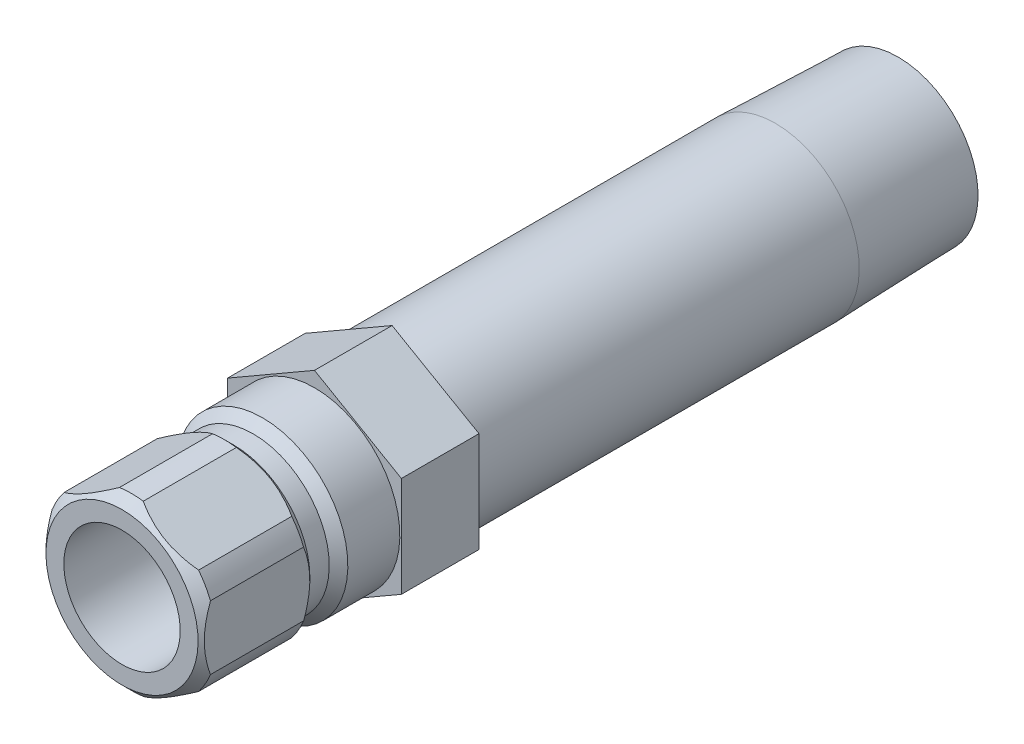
ISO-10303-21;
HEADER;
FILE_DESCRIPTION(('STEP AP214'),'2;1');
FILE_NAME('part.step','',(''),(''),'','','');
FILE_SCHEMA(('AUTOMOTIVE_DESIGN { 1 0 10303 214 1 1 1 1 }'));
ENDSEC;
DATA;
#1=APPLICATION_CONTEXT('core data for automotive mechanical design processes');
#2=APPLICATION_PROTOCOL_DEFINITION('international standard','automotive_design',2000,#1);
#3=PRODUCT_CONTEXT('',#1,'mechanical');
#4=PRODUCT('Part','Part','',(#3));
#5=PRODUCT_RELATED_PRODUCT_CATEGORY('part','',(#4));
#6=PRODUCT_DEFINITION_FORMATION('','',#4);
#7=PRODUCT_DEFINITION_CONTEXT('part definition',#1,'design');
#8=PRODUCT_DEFINITION('design','',#6,#7);
#9=PRODUCT_DEFINITION_SHAPE('','',#8);
#10=(LENGTH_UNIT() NAMED_UNIT(*) SI_UNIT(.MILLI.,.METRE.));
#11=(NAMED_UNIT(*) PLANE_ANGLE_UNIT() SI_UNIT($,.RADIAN.));
#12=(NAMED_UNIT(*) SI_UNIT($,.STERADIAN.) SOLID_ANGLE_UNIT());
#13=UNCERTAINTY_MEASURE_WITH_UNIT(LENGTH_MEASURE(1.E-05),#10,'distance_accuracy_value','');
#14=(GEOMETRIC_REPRESENTATION_CONTEXT(3) GLOBAL_UNCERTAINTY_ASSIGNED_CONTEXT((#13)) GLOBAL_UNIT_ASSIGNED_CONTEXT((#10,
#11,#12)) REPRESENTATION_CONTEXT('',''));
#15=CARTESIAN_POINT('',(0.,0.,0.));
#16=DIRECTION('',(0.,0.,1.));
#17=DIRECTION('',(1.,0.,0.));
#18=AXIS2_PLACEMENT_3D('',#15,#16,#17);
#19=CARTESIAN_POINT('',(0.,0.,12.8748331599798));
#20=DIRECTION('',(0.,0.,-1.));
#21=DIRECTION('',(0.,1.,0.));
#22=AXIS2_PLACEMENT_3D('',#19,#20,#21);
#23=CYLINDRICAL_SURFACE('',#22,6.985);
#24=DIRECTION('',(0.,0.,-1.));
#25=VECTOR('',#24,1.);
#26=CARTESIAN_POINT('',(5.50323442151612,-4.30170151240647,12.8748331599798));
#27=LINE('',#26,#25);
#28=CARTESIAN_POINT('',(5.50323442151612,-4.30170151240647,7.366));
#29=VERTEX_POINT('',#28);
#30=CARTESIAN_POINT('',(5.50323442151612,-4.30170151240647,14.986));
#31=VERTEX_POINT('',#30);
#32=EDGE_CURVE('E452',#29,#31,#27,.F.);
#33=ORIENTED_EDGE('',*,*,#32,.F.);
#34=CARTESIAN_POINT('',(0.,0.,7.366));
#35=DIRECTION('',(0.,0.,-1.));
#36=DIRECTION('',(0.,1.,0.));
#37=AXIS2_PLACEMENT_3D('',#34,#35,#36);
#38=CIRCLE('',#37,6.985);
#39=CARTESIAN_POINT('',(6.477,-2.6150900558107,7.366));
#40=VERTEX_POINT('',#39);
#41=EDGE_CURVE('E190',#40,#29,#38,.T.);
#42=ORIENTED_EDGE('',*,*,#41,.F.);
#43=DIRECTION('',(0.,0.,-1.));
#44=VECTOR('',#43,1.);
#45=CARTESIAN_POINT('',(6.477,-2.6150900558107,12.8748331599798));
#46=LINE('',#45,#44);
#47=CARTESIAN_POINT('',(6.477,-2.6150900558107,14.986));
#48=VERTEX_POINT('',#47);
#49=EDGE_CURVE('E367',#48,#40,#46,.T.);
#50=ORIENTED_EDGE('',*,*,#49,.F.);
#51=CARTESIAN_POINT('',(0.,0.,14.986));
#52=DIRECTION('',(0.,0.,-1.));
#53=DIRECTION('',(0.,1.,0.));
#54=AXIS2_PLACEMENT_3D('',#51,#52,#53);
#55=CIRCLE('',#54,6.985);
#56=EDGE_CURVE('E355',#48,#31,#55,.T.);
#57=ORIENTED_EDGE('',*,*,#56,.T.);
#58=EDGE_LOOP('',(#33,#42,#50,#57));
#59=FACE_BOUND('',#58,.T.);
#60=ADVANCED_FACE('F34',(#59),#23,.T.);
#61=DIRECTION('',(0.,0.,-1.));
#62=VECTOR('',#61,1.);
#63=CARTESIAN_POINT('',(6.477,2.6150900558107,12.8748331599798));
#64=LINE('',#63,#62);
#65=CARTESIAN_POINT('',(6.477,2.6150900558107,7.366));
#66=VERTEX_POINT('',#65);
#67=CARTESIAN_POINT('',(6.477,2.6150900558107,14.986));
#68=VERTEX_POINT('',#67);
#69=EDGE_CURVE('E279',#66,#68,#64,.F.);
#70=ORIENTED_EDGE('',*,*,#69,.F.);
#71=CARTESIAN_POINT('',(5.50323442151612,4.30170151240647,7.366));
#72=VERTEX_POINT('',#71);
#73=EDGE_CURVE('E193',#72,#66,#38,.T.);
#74=ORIENTED_EDGE('',*,*,#73,.F.);
#75=DIRECTION('',(0.,0.,-1.));
#76=VECTOR('',#75,1.);
#77=CARTESIAN_POINT('',(5.50323442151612,4.30170151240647,12.8748331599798));
#78=LINE('',#77,#76);
#79=CARTESIAN_POINT('',(5.50323442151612,4.30170151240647,14.986));
#80=VERTEX_POINT('',#79);
#81=EDGE_CURVE('E351',#80,#72,#78,.T.);
#82=ORIENTED_EDGE('',*,*,#81,.F.);
#83=EDGE_CURVE('E205',#80,#68,#55,.T.);
#84=ORIENTED_EDGE('',*,*,#83,.T.);
#85=EDGE_LOOP('',(#70,#74,#82,#84));
#86=FACE_BOUND('',#85,.T.);
#87=ADVANCED_FACE('F313',(#86),#23,.T.);
#88=DIRECTION('',(0.,0.,-1.));
#89=VECTOR('',#88,1.);
#90=CARTESIAN_POINT('',(0.973765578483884,6.91679156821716,12.8748331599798));
#91=LINE('',#90,#89);
#92=CARTESIAN_POINT('',(0.973765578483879,6.91679156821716,7.366));
#93=VERTEX_POINT('',#92);
#94=CARTESIAN_POINT('',(0.973765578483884,6.91679156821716,14.986));
#95=VERTEX_POINT('',#94);
#96=EDGE_CURVE('E370',#93,#95,#91,.F.);
#97=ORIENTED_EDGE('',*,*,#96,.F.);
#98=CARTESIAN_POINT('',(-0.97376557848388,6.91679156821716,7.366));
#99=VERTEX_POINT('',#98);
#100=EDGE_CURVE('E195',#99,#93,#38,.T.);
#101=ORIENTED_EDGE('',*,*,#100,.F.);
#102=DIRECTION('',(0.,0.,-1.));
#103=VECTOR('',#102,1.);
#104=CARTESIAN_POINT('',(-0.973765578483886,6.91679156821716,12.8748331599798));
#105=LINE('',#104,#103);
#106=CARTESIAN_POINT('',(-0.973765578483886,6.91679156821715,14.986));
#107=VERTEX_POINT('',#106);
#108=EDGE_CURVE('E54',#107,#99,#105,.T.);
#109=ORIENTED_EDGE('',*,*,#108,.F.);
#110=EDGE_CURVE('E201',#107,#95,#55,.T.);
#111=ORIENTED_EDGE('',*,*,#110,.T.);
#112=EDGE_LOOP('',(#97,#101,#109,#111));
#113=FACE_BOUND('',#112,.T.);
#114=ADVANCED_FACE('F318',(#113),#23,.T.);
#115=DIRECTION('',(0.,0.,-1.));
#116=VECTOR('',#115,1.);
#117=CARTESIAN_POINT('',(-5.50323442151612,4.30170151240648,12.8748331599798));
#118=LINE('',#117,#116);
#119=CARTESIAN_POINT('',(-5.50323442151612,4.30170151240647,7.366));
#120=VERTEX_POINT('',#119);
#121=CARTESIAN_POINT('',(-5.50323442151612,4.30170151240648,14.986));
#122=VERTEX_POINT('',#121);
#123=EDGE_CURVE('E349',#120,#122,#118,.F.);
#124=ORIENTED_EDGE('',*,*,#123,.F.);
#125=CARTESIAN_POINT('',(-6.477,2.61509005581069,7.366));
#126=VERTEX_POINT('',#125);
#127=EDGE_CURVE('E194',#126,#120,#38,.T.);
#128=ORIENTED_EDGE('',*,*,#127,.F.);
#129=DIRECTION('',(0.,0.,-1.));
#130=VECTOR('',#129,1.);
#131=CARTESIAN_POINT('',(-6.477,2.61509005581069,12.8748331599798));
#132=LINE('',#131,#130);
#133=CARTESIAN_POINT('',(-6.477,2.61509005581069,14.986));
#134=VERTEX_POINT('',#133);
#135=EDGE_CURVE('E62',#134,#126,#132,.T.);
#136=ORIENTED_EDGE('',*,*,#135,.F.);
#137=EDGE_CURVE('E204',#134,#122,#55,.T.);
#138=ORIENTED_EDGE('',*,*,#137,.T.);
#139=EDGE_LOOP('',(#124,#128,#136,#138));
#140=FACE_BOUND('',#139,.T.);
#141=ADVANCED_FACE('F329',(#140),#23,.T.);
#142=DIRECTION('',(0.,0.,-1.));
#143=VECTOR('',#142,1.);
#144=CARTESIAN_POINT('',(-6.477,-2.61509005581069,12.8748331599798));
#145=LINE('',#144,#143);
#146=CARTESIAN_POINT('',(-6.477,-2.61509005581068,7.366));
#147=VERTEX_POINT('',#146);
#148=CARTESIAN_POINT('',(-6.477,-2.61509005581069,14.986));
#149=VERTEX_POINT('',#148);
#150=EDGE_CURVE('E340',#147,#149,#145,.F.);
#151=ORIENTED_EDGE('',*,*,#150,.F.);
#152=CARTESIAN_POINT('',(-5.50323442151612,-4.30170151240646,7.366));
#153=VERTEX_POINT('',#152);
#154=EDGE_CURVE('E191',#153,#147,#38,.T.);
#155=ORIENTED_EDGE('',*,*,#154,.F.);
#156=DIRECTION('',(0.,0.,-1.));
#157=VECTOR('',#156,1.);
#158=CARTESIAN_POINT('',(-5.50323442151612,-4.30170151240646,12.8748331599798));
#159=LINE('',#158,#157);
#160=CARTESIAN_POINT('',(-5.50323442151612,-4.30170151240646,14.986));
#161=VERTEX_POINT('',#160);
#162=EDGE_CURVE('E168',#161,#153,#159,.T.);
#163=ORIENTED_EDGE('',*,*,#162,.F.);
#164=EDGE_CURVE('E342',#161,#149,#55,.T.);
#165=ORIENTED_EDGE('',*,*,#164,.T.);
#166=EDGE_LOOP('',(#151,#155,#163,#165));
#167=FACE_BOUND('',#166,.T.);
#168=ADVANCED_FACE('F322',(#167),#23,.T.);
#169=CARTESIAN_POINT('',(0.,0.,12.8748331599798));
#170=DIRECTION('',(0.,0.,-1.));
#171=DIRECTION('',(0.,1.,0.));
#172=AXIS2_PLACEMENT_3D('',#169,#170,#171);
#173=CYLINDRICAL_SURFACE('',#172,6.85799999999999);
#174=CARTESIAN_POINT('',(0.,0.,-37.719));
#175=DIRECTION('',(0.,0.,-1.));
#176=DIRECTION('',(0.,1.,0.));
#177=AXIS2_PLACEMENT_3D('',#174,#175,#176);
#178=CIRCLE('',#177,6.85799999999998);
#179=CARTESIAN_POINT('',(0.,6.858,-37.719));
#180=VERTEX_POINT('',#179);
#181=EDGE_CURVE('E520',#180,#180,#178,.T.);
#182=ORIENTED_EDGE('',*,*,#181,.F.);
#183=EDGE_LOOP('',(#182));
#184=FACE_BOUND('',#183,.T.);
#185=CARTESIAN_POINT('',(0.,0.,-6.35));
#186=DIRECTION('',(0.,0.,1.));
#187=DIRECTION('',(1.,0.,0.));
#188=AXIS2_PLACEMENT_3D('',#185,#186,#187);
#189=CIRCLE('',#188,6.85799999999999);
#190=CARTESIAN_POINT('',(6.85799999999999,0.,-6.35));
#191=VERTEX_POINT('',#190);
#192=EDGE_CURVE('E496',#191,#191,#189,.F.);
#193=ORIENTED_EDGE('',*,*,#192,.T.);
#194=EDGE_LOOP('',(#193));
#195=FACE_BOUND('',#194,.T.);
#196=ADVANCED_FACE('F328',(#184,#195),#173,.T.);
#197=CARTESIAN_POINT('',(0.,0.,12.8748331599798));
#198=DIRECTION('',(0.,0.,-1.));
#199=DIRECTION('',(0.,1.,0.));
#200=AXIS2_PLACEMENT_3D('',#197,#198,#199);
#201=CYLINDRICAL_SURFACE('',#200,4.7625);
#202=CARTESIAN_POINT('',(0.,0.,3.556));
#203=DIRECTION('',(0.,0.,-1.));
#204=DIRECTION('',(0.,1.,0.));
#205=AXIS2_PLACEMENT_3D('',#202,#203,#204);
#206=CIRCLE('',#205,4.76249999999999);
#207=CARTESIAN_POINT('',(0.,4.7625,3.556));
#208=VERTEX_POINT('',#207);
#209=EDGE_CURVE('E508',#208,#208,#206,.T.);
#210=ORIENTED_EDGE('',*,*,#209,.T.);
#211=EDGE_LOOP('',(#210));
#212=FACE_BOUND('',#211,.T.);
#213=CARTESIAN_POINT('',(0.,0.,15.748));
#214=DIRECTION('',(0.,0.,-1.));
#215=DIRECTION('',(0.,1.,0.));
#216=AXIS2_PLACEMENT_3D('',#213,#214,#215);
#217=CIRCLE('',#216,4.7625);
#218=CARTESIAN_POINT('',(0.,4.7625,15.748));
#219=VERTEX_POINT('',#218);
#220=EDGE_CURVE('E174',#219,#219,#217,.T.);
#221=ORIENTED_EDGE('',*,*,#220,.F.);
#222=EDGE_LOOP('',(#221));
#223=FACE_BOUND('',#222,.T.);
#224=ADVANCED_FACE('F36',(#212,#223),#201,.F.);
#225=CARTESIAN_POINT('',(0.,4.7625,15.748));
#226=DIRECTION('',(0.,0.,1.));
#227=DIRECTION('',(0.,-1.,0.));
#228=AXIS2_PLACEMENT_3D('',#225,#226,#227);
#229=PLANE('',#228);
#230=ORIENTED_EDGE('',*,*,#220,.T.);
#231=EDGE_LOOP('',(#230));
#232=FACE_BOUND('',#231,.T.);
#233=CARTESIAN_POINT('',(0.,0.,15.748));
#234=DIRECTION('',(0.,0.,-1.));
#235=DIRECTION('',(0.,1.,0.));
#236=AXIS2_PLACEMENT_3D('',#233,#234,#235);
#237=CIRCLE('',#236,6.223);
#238=CARTESIAN_POINT('',(0.,6.223,15.748));
#239=VERTEX_POINT('',#238);
#240=EDGE_CURVE('E206',#239,#239,#237,.T.);
#241=ORIENTED_EDGE('',*,*,#240,.F.);
#242=EDGE_LOOP('',(#241));
#243=FACE_BOUND('',#242,.T.);
#244=ADVANCED_FACE('F241',(#232,#243),#229,.T.);
#245=CARTESIAN_POINT('',(0.,0.,14.986));
#246=DIRECTION('',(0.,0.,-1.));
#247=DIRECTION('',(0.,1.,0.));
#248=AXIS2_PLACEMENT_3D('',#245,#246,#247);
#249=CONICAL_SURFACE('',#248,6.985,0.785398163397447);
#250=CARTESIAN_POINT('',(5.50369701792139,-4.30143443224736,14.9858));
#251=CARTESIAN_POINT('',(5.32269478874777,-4.40593611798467,15.0641166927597));
#252=CARTESIAN_POINT('',(5.13917907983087,-4.51188896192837,15.1353544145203));
#253=CARTESIAN_POINT('',(4.76736839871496,-4.72655395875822,15.2608524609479));
#254=CARTESIAN_POINT('',(4.57906245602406,-4.83527244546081,15.3150691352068));
#255=CARTESIAN_POINT('',(4.20553846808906,-5.05092662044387,15.401724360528));
#256=CARTESIAN_POINT('',(4.02044501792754,-5.15779037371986,15.4348622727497));
#257=CARTESIAN_POINT('',(3.64855359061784,-5.37250198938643,15.4802195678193));
#258=CARTESIAN_POINT('',(3.46175806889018,-5.48034843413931,15.4924653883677));
#259=CARTESIAN_POINT('',(3.08219421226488,-5.69948972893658,15.4953056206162));
#260=CARTESIAN_POINT('',(2.88942157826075,-5.81078706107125,15.4852117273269));
#261=CARTESIAN_POINT('',(2.50551871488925,-6.03243348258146,15.4426708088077));
#262=CARTESIAN_POINT('',(2.31439108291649,-6.14278107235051,15.4101933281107));
#263=CARTESIAN_POINT('',(1.92845877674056,-6.36559919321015,15.3234273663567));
#264=CARTESIAN_POINT('',(1.73378601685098,-6.47799356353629,15.268364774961));
#265=CARTESIAN_POINT('',(1.44558978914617,-6.6443837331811,15.1720079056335));
#266=CARTESIAN_POINT('',(1.35026676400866,-6.69941850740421,15.1376422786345));
#267=CARTESIAN_POINT('',(1.16086120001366,-6.80877186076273,15.0647445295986));
#268=CARTESIAN_POINT('',(1.06677820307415,-6.86309070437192,15.0262139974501));
#269=CARTESIAN_POINT('',(0.973302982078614,-6.91705864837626,14.9858));
#270=B_SPLINE_CURVE_WITH_KNOTS('',3,(#250,#251,#252,#253,#254,#255,#256,#257,#258,#259,#260,
#261,#262,#263,#264,#265,#266,#267,#268,#269),.UNSPECIFIED.,.F.,.F.,(4,2,2,2,2,2,2,2,2,4),(0.,
0.669810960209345,1.34132587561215,1.9892054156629,2.63626449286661,3.30353665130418,
3.97171850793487,4.66502165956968,5.01088265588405,5.35661208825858),.UNSPECIFIED.);
#271=CARTESIAN_POINT('',(0.973765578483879,-6.91679156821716,14.986));
#272=VERTEX_POINT('',#271);
#273=EDGE_CURVE('E451',#31,#272,#270,.T.);
#274=ORIENTED_EDGE('',*,*,#273,.F.);
#275=ORIENTED_EDGE('',*,*,#56,.F.);
#276=CARTESIAN_POINT('',(6.477,-7.50531717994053,12.0573066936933));
#277=CARTESIAN_POINT('',(6.477,-7.32278230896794,12.1954662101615));
#278=CARTESIAN_POINT('',(6.477,-7.13923073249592,12.3323042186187));
#279=CARTESIAN_POINT('',(6.477,-6.76969107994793,12.6027438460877));
#280=CARTESIAN_POINT('',(6.477,-6.58370240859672,12.7363446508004));
#281=CARTESIAN_POINT('',(6.477,-6.20752484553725,13.0006667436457));
#282=CARTESIAN_POINT('',(6.477,-6.01731457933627,13.1313577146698));
#283=CARTESIAN_POINT('',(6.477,-5.63367369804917,13.3879087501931));
#284=CARTESIAN_POINT('',(6.477,-5.44024331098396,13.5137691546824));
#285=CARTESIAN_POINT('',(6.477,-5.03831720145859,13.7667102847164));
#286=CARTESIAN_POINT('',(6.477,-4.8295984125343,13.893438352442));
#287=CARTESIAN_POINT('',(6.477,-4.4072839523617,14.1386241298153));
#288=CARTESIAN_POINT('',(6.477,-4.19368750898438,14.2570805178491));
#289=CARTESIAN_POINT('',(6.477,-3.7616267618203,14.4831715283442));
#290=CARTESIAN_POINT('',(6.477,-3.54317924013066,14.5908379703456));
#291=CARTESIAN_POINT('',(6.477,-3.100295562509,14.7929384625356));
#292=CARTESIAN_POINT('',(6.477,-2.87586219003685,14.8873785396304));
#293=CARTESIAN_POINT('',(6.477,-2.43955826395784,15.0524966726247));
#294=CARTESIAN_POINT('',(6.477,-2.22819339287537,15.1244971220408));
#295=CARTESIAN_POINT('',(6.477,-1.80033354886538,15.2515475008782));
#296=CARTESIAN_POINT('',(6.477,-1.58383822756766,15.3065962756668));
#297=CARTESIAN_POINT('',(6.477,-1.15063390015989,15.3959385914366));
#298=CARTESIAN_POINT('',(6.477,-0.934000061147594,15.4305906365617));
#299=CARTESIAN_POINT('',(6.477,-0.498364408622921,15.4784594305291));
#300=CARTESIAN_POINT('',(6.477,-0.279363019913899,15.4916799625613));
#301=CARTESIAN_POINT('',(6.477,0.150697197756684,15.4956835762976));
#302=CARTESIAN_POINT('',(6.477,0.361748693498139,15.4872823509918));
#303=CARTESIAN_POINT('',(6.477,0.782066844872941,15.4503172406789));
#304=CARTESIAN_POINT('',(6.477,0.991333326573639,15.421751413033));
#305=CARTESIAN_POINT('',(6.477,1.41010575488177,15.3455375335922));
#306=CARTESIAN_POINT('',(6.477,1.6195513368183,15.2975631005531));
#307=CARTESIAN_POINT('',(6.477,2.03387291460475,15.1851046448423));
#308=CARTESIAN_POINT('',(6.477,2.2387492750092,15.1206219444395));
#309=CARTESIAN_POINT('',(6.477,2.66141718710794,14.9715598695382));
#310=CARTESIAN_POINT('',(6.477,2.87875617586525,14.8857103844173));
#311=CARTESIAN_POINT('',(6.477,3.30779766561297,14.7008180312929));
#312=CARTESIAN_POINT('',(6.477,3.51949749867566,14.6017690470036));
#313=CARTESIAN_POINT('',(6.477,3.9382898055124,14.3928329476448));
#314=CARTESIAN_POINT('',(6.477,4.14536521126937,14.282911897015));
#315=CARTESIAN_POINT('',(6.477,4.55475391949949,14.0546596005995));
#316=CARTESIAN_POINT('',(6.477,4.75706796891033,13.93632968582));
#317=CARTESIAN_POINT('',(6.477,5.14761370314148,13.6989609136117));
#318=CARTESIAN_POINT('',(6.477,5.33604552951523,13.580249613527));
#319=CARTESIAN_POINT('',(6.477,5.70967381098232,13.3378251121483));
#320=CARTESIAN_POINT('',(6.477,5.89487001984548,13.2141115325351));
#321=CARTESIAN_POINT('',(6.477,6.26095063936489,12.9635958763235));
#322=CARTESIAN_POINT('',(6.477,6.44185783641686,12.8368269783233));
#323=CARTESIAN_POINT('',(6.477,6.80119835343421,12.5799293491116));
#324=CARTESIAN_POINT('',(6.477,6.97963234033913,12.4498015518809));
#325=CARTESIAN_POINT('',(6.477,7.15703038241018,12.3183002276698));
#326=B_SPLINE_CURVE_WITH_KNOTS('',3,(#276,#277,#278,#279,#280,#281,#282,#283,#284,#285,#286,
#287,#288,#289,#290,#291,#292,#293,#294,#295,#296,#297,#298,#299,#300,#301,#302,#303,#304,#305,
#306,#307,#308,#309,#310,#311,#312,#313,#314,#315,#316,#317,#318,#319,#320,#321,#322,#323,#324,
#325),.UNSPECIFIED.,.F.,.F.,(4,2,2,2,2,2,2,2,2,2,2,2,2,2,2,2,2,2,2,2,2,2,2,2,4),(0.,
0.686790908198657,1.37375281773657,2.06603541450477,2.75826919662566,3.49065471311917,
4.22315698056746,4.95343127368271,5.68337170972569,6.35265989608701,7.02199365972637,
7.67918147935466,8.33625327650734,8.96890298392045,9.6016136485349,10.2454384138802,
10.8892116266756,11.5897073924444,12.2905288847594,12.9936114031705,13.6965828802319,
14.3646145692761,15.0326968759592,15.6953618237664,16.3578444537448),.UNSPECIFIED.);
#327=EDGE_CURVE('E271',#68,#48,#326,.F.);
#328=ORIENTED_EDGE('',*,*,#327,.F.);
#329=ORIENTED_EDGE('',*,*,#83,.F.);
#330=CARTESIAN_POINT('',(0.973302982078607,6.91705864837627,14.9858));
#331=CARTESIAN_POINT('',(1.15430521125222,6.81255696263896,15.0641166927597));
#332=CARTESIAN_POINT('',(1.33782092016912,6.70660411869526,15.1353544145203));
#333=CARTESIAN_POINT('',(1.70963160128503,6.49193912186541,15.2608524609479));
#334=CARTESIAN_POINT('',(1.89793754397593,6.38322063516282,15.3150691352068));
#335=CARTESIAN_POINT('',(2.27146153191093,6.16756646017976,15.401724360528));
#336=CARTESIAN_POINT('',(2.45655498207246,6.06070270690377,15.4348622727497));
#337=CARTESIAN_POINT('',(2.82844640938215,5.8459910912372,15.4802195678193));
#338=CARTESIAN_POINT('',(3.01524193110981,5.73814464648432,15.4924653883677));
#339=CARTESIAN_POINT('',(3.39480578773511,5.51900335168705,15.4953056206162));
#340=CARTESIAN_POINT('',(3.58757842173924,5.40770601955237,15.4852117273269));
#341=CARTESIAN_POINT('',(3.97148128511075,5.18605959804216,15.4426708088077));
#342=CARTESIAN_POINT('',(4.16260891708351,5.07571200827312,15.4101933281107));
#343=CARTESIAN_POINT('',(4.54854122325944,4.85289388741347,15.3234273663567));
#344=CARTESIAN_POINT('',(4.74321398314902,4.74049951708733,15.268364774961));
#345=CARTESIAN_POINT('',(5.03141021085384,4.57410934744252,15.1720079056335));
#346=CARTESIAN_POINT('',(5.12673323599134,4.51907457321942,15.1376422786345));
#347=CARTESIAN_POINT('',(5.31613879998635,4.40972121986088,15.0647445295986));
#348=CARTESIAN_POINT('',(5.41022179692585,4.3554023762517,15.0262139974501));
#349=CARTESIAN_POINT('',(5.50369701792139,4.30143443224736,14.9858));
#350=B_SPLINE_CURVE_WITH_KNOTS('',3,(#330,#331,#332,#333,#334,#335,#336,#337,#338,#339,#340,
#341,#342,#343,#344,#345,#346,#347,#348,#349),.UNSPECIFIED.,.F.,.F.,(4,2,2,2,2,2,2,2,2,4),(0.,
0.669810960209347,1.34132587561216,1.9892054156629,2.63626449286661,3.30353665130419,
3.97171850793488,4.66502165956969,5.01088265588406,5.35661208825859),.UNSPECIFIED.);
#351=EDGE_CURVE('E263',#95,#80,#350,.T.);
#352=ORIENTED_EDGE('',*,*,#351,.F.);
#353=ORIENTED_EDGE('',*,*,#110,.F.);
#354=CARTESIAN_POINT('',(-5.50369701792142,4.30143443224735,14.9858));
#355=CARTESIAN_POINT('',(-5.3226947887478,4.40593611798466,15.0641166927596));
#356=CARTESIAN_POINT('',(-5.1391790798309,4.51188896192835,15.1353544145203));
#357=CARTESIAN_POINT('',(-4.76736839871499,4.72655395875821,15.2608524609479));
#358=CARTESIAN_POINT('',(-4.57906245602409,4.8352724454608,15.3150691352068));
#359=CARTESIAN_POINT('',(-4.20553846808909,5.05092662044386,15.401724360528));
#360=CARTESIAN_POINT('',(-4.02044501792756,5.15779037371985,15.4348622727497));
#361=CARTESIAN_POINT('',(-3.64855359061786,5.37250198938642,15.4802195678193));
#362=CARTESIAN_POINT('',(-3.4617580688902,5.4803484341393,15.4924653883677));
#363=CARTESIAN_POINT('',(-3.0821942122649,5.69948972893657,15.4953056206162));
#364=CARTESIAN_POINT('',(-2.88942157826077,5.81078706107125,15.4852117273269));
#365=CARTESIAN_POINT('',(-2.50551871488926,6.03243348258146,15.4426708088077));
#366=CARTESIAN_POINT('',(-2.3143910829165,6.14278107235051,15.4101933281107));
#367=CARTESIAN_POINT('',(-1.92845877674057,6.36559919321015,15.3234273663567));
#368=CARTESIAN_POINT('',(-1.73378601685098,6.47799356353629,15.268364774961));
#369=CARTESIAN_POINT('',(-1.44558978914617,6.6443837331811,15.1720079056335));
#370=CARTESIAN_POINT('',(-1.35026676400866,6.69941850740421,15.1376422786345));
#371=CARTESIAN_POINT('',(-1.16086120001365,6.80877186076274,15.0647445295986));
#372=CARTESIAN_POINT('',(-1.06677820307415,6.86309070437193,15.0262139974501));
#373=CARTESIAN_POINT('',(-0.97330298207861,6.91705864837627,14.9858));
#374=B_SPLINE_CURVE_WITH_KNOTS('',3,(#354,#355,#356,#357,#358,#359,#360,#361,#362,#363,#364,
#365,#366,#367,#368,#369,#370,#371,#372,#373),.UNSPECIFIED.,.F.,.F.,(4,2,2,2,2,2,2,2,2,4),(0.,
0.66981096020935,1.34132587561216,1.98920541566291,2.63626449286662,3.3035366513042,
3.9717185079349,4.66502165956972,5.01088265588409,5.35661208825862),.UNSPECIFIED.);
#375=EDGE_CURVE('E256',#122,#107,#374,.T.);
#376=ORIENTED_EDGE('',*,*,#375,.F.);
#377=ORIENTED_EDGE('',*,*,#137,.F.);
#378=CARTESIAN_POINT('',(-6.477,-7.50531717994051,12.0573066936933));
#379=CARTESIAN_POINT('',(-6.477,-7.32278230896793,12.1954662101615));
#380=CARTESIAN_POINT('',(-6.477,-7.13923073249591,12.3323042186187));
#381=CARTESIAN_POINT('',(-6.477,-6.76969107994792,12.6027438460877));
#382=CARTESIAN_POINT('',(-6.477,-6.58370240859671,12.7363446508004));
#383=CARTESIAN_POINT('',(-6.477,-6.20752484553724,13.0006667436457));
#384=CARTESIAN_POINT('',(-6.477,-6.01731457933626,13.1313577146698));
#385=CARTESIAN_POINT('',(-6.477,-5.63367369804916,13.3879087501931));
#386=CARTESIAN_POINT('',(-6.477,-5.44024331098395,13.5137691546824));
#387=CARTESIAN_POINT('',(-6.477,-5.03831720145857,13.7667102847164));
#388=CARTESIAN_POINT('',(-6.477,-4.82959841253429,13.8934383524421));
#389=CARTESIAN_POINT('',(-6.477,-4.40728395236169,14.1386241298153));
#390=CARTESIAN_POINT('',(-6.477,-4.19368750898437,14.2570805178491));
#391=CARTESIAN_POINT('',(-6.477,-3.76162676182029,14.4831715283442));
#392=CARTESIAN_POINT('',(-6.477,-3.54317924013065,14.5908379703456));
#393=CARTESIAN_POINT('',(-6.477,-3.10029556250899,14.7929384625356));
#394=CARTESIAN_POINT('',(-6.477,-2.87586219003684,14.8873785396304));
#395=CARTESIAN_POINT('',(-6.477,-2.43955826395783,15.0524966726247));
#396=CARTESIAN_POINT('',(-6.477,-2.22819339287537,15.1244971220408));
#397=CARTESIAN_POINT('',(-6.477,-1.80033354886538,15.2515475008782));
#398=CARTESIAN_POINT('',(-6.477,-1.58383822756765,15.3065962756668));
#399=CARTESIAN_POINT('',(-6.477,-1.15063390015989,15.3959385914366));
#400=CARTESIAN_POINT('',(-6.477,-0.934000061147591,15.4305906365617));
#401=CARTESIAN_POINT('',(-6.477,-0.49836440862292,15.4784594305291));
#402=CARTESIAN_POINT('',(-6.477,-0.279363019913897,15.4916799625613));
#403=CARTESIAN_POINT('',(-6.477,0.150697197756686,15.4956835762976));
#404=CARTESIAN_POINT('',(-6.477,0.361748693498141,15.4872823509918));
#405=CARTESIAN_POINT('',(-6.477,0.782066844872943,15.4503172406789));
#406=CARTESIAN_POINT('',(-6.477,0.991333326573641,15.421751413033));
#407=CARTESIAN_POINT('',(-6.477,1.41010575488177,15.3455375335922));
#408=CARTESIAN_POINT('',(-6.477,1.6195513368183,15.2975631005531));
#409=CARTESIAN_POINT('',(-6.477,2.03387291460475,15.1851046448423));
#410=CARTESIAN_POINT('',(-6.477,2.2387492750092,15.1206219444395));
#411=CARTESIAN_POINT('',(-6.477,2.66141718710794,14.9715598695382));
#412=CARTESIAN_POINT('',(-6.477,2.87875617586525,14.8857103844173));
#413=CARTESIAN_POINT('',(-6.477,3.30779766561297,14.7008180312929));
#414=CARTESIAN_POINT('',(-6.477,3.51949749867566,14.6017690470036));
#415=CARTESIAN_POINT('',(-6.477,3.93828980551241,14.3928329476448));
#416=CARTESIAN_POINT('',(-6.477,4.14536521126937,14.282911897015));
#417=CARTESIAN_POINT('',(-6.477,4.55475391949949,14.0546596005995));
#418=CARTESIAN_POINT('',(-6.477,4.75706796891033,13.93632968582));
#419=CARTESIAN_POINT('',(-6.477,5.14761370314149,13.6989609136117));
#420=CARTESIAN_POINT('',(-6.477,5.33604552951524,13.580249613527));
#421=CARTESIAN_POINT('',(-6.477,5.70967381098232,13.3378251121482));
#422=CARTESIAN_POINT('',(-6.477,5.89487001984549,13.2141115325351));
#423=CARTESIAN_POINT('',(-6.477,6.2609506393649,12.9635958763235));
#424=CARTESIAN_POINT('',(-6.477,6.44185783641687,12.8368269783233));
#425=CARTESIAN_POINT('',(-6.477,6.80119835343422,12.5799293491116));
#426=CARTESIAN_POINT('',(-6.477,6.97963234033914,12.4498015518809));
#427=CARTESIAN_POINT('',(-6.477,7.15703038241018,12.3183002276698));
#428=B_SPLINE_CURVE_WITH_KNOTS('',3,(#378,#379,#380,#381,#382,#383,#384,#385,#386,#387,#388,
#389,#390,#391,#392,#393,#394,#395,#396,#397,#398,#399,#400,#401,#402,#403,#404,#405,#406,#407,
#408,#409,#410,#411,#412,#413,#414,#415,#416,#417,#418,#419,#420,#421,#422,#423,#424,#425,#426,
#427),.UNSPECIFIED.,.F.,.F.,(4,2,2,2,2,2,2,2,2,2,2,2,2,2,2,2,2,2,2,2,2,2,2,2,4),(0.,
0.686790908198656,1.37375281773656,2.06603541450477,2.75826919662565,3.49065471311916,
4.22315698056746,4.9534312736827,5.68337170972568,6.352659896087,7.02199365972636,
7.67918147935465,8.33625327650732,8.96890298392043,9.60161364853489,10.2454384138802,
10.8892116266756,11.5897073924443,12.2905288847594,12.9936114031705,13.6965828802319,
14.3646145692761,15.0326968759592,15.6953618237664,16.3578444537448),.UNSPECIFIED.);
#429=EDGE_CURVE('E249',#149,#134,#428,.T.);
#430=ORIENTED_EDGE('',*,*,#429,.F.);
#431=ORIENTED_EDGE('',*,*,#164,.F.);
#432=CARTESIAN_POINT('',(-0.973302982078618,-6.91705864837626,14.9858));
#433=CARTESIAN_POINT('',(-1.15430521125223,-6.81255696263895,15.0641166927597));
#434=CARTESIAN_POINT('',(-1.33782092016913,-6.70660411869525,15.1353544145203));
#435=CARTESIAN_POINT('',(-1.70963160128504,-6.49193912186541,15.2608524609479));
#436=CARTESIAN_POINT('',(-1.89793754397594,-6.38322063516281,15.3150691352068));
#437=CARTESIAN_POINT('',(-2.27146153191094,-6.16756646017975,15.401724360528));
#438=CARTESIAN_POINT('',(-2.45655498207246,-6.06070270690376,15.4348622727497));
#439=CARTESIAN_POINT('',(-2.82844640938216,-5.84599109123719,15.4802195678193));
#440=CARTESIAN_POINT('',(-3.01524193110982,-5.73814464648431,15.4924653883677));
#441=CARTESIAN_POINT('',(-3.39480578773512,-5.51900335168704,15.4953056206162));
#442=CARTESIAN_POINT('',(-3.58757842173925,-5.40770601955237,15.4852117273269));
#443=CARTESIAN_POINT('',(-3.97148128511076,-5.18605959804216,15.4426708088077));
#444=CARTESIAN_POINT('',(-4.16260891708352,-5.07571200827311,15.4101933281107));
#445=CARTESIAN_POINT('',(-4.54854122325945,-4.85289388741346,15.3234273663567));
#446=CARTESIAN_POINT('',(-4.74321398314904,-4.74049951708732,15.268364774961));
#447=CARTESIAN_POINT('',(-5.03141021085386,-4.57410934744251,15.1720079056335));
#448=CARTESIAN_POINT('',(-5.12673323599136,-4.5190745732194,15.1376422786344));
#449=CARTESIAN_POINT('',(-5.31613879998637,-4.40972121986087,15.0647445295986));
#450=CARTESIAN_POINT('',(-5.41022179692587,-4.35540237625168,15.0262139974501));
#451=CARTESIAN_POINT('',(-5.50369701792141,-4.30143443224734,14.9858));
#452=B_SPLINE_CURVE_WITH_KNOTS('',3,(#432,#433,#434,#435,#436,#437,#438,#439,#440,#441,#442,
#443,#444,#445,#446,#447,#448,#449,#450,#451),.UNSPECIFIED.,.F.,.F.,(4,2,2,2,2,2,2,2,2,4),(0.,
0.669810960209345,1.34132587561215,1.9892054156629,2.6362644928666,3.30353665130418,
3.97171850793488,4.6650216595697,5.01088265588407,5.35661208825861),.UNSPECIFIED.);
#453=CARTESIAN_POINT('',(-0.973765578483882,-6.91679156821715,14.986));
#454=VERTEX_POINT('',#453);
#455=EDGE_CURVE('E184',#454,#161,#452,.T.);
#456=ORIENTED_EDGE('',*,*,#455,.F.);
#457=EDGE_CURVE('E183',#272,#454,#55,.T.);
#458=ORIENTED_EDGE('',*,*,#457,.F.);
#459=EDGE_LOOP('',(#274,#275,#328,#329,#352,#353,#376,#377,#430,#431,#456,#458));
#460=FACE_BOUND('',#459,.T.);
#461=ORIENTED_EDGE('',*,*,#240,.T.);
#462=EDGE_LOOP('',(#461));
#463=FACE_BOUND('',#462,.T.);
#464=ADVANCED_FACE('F238',(#460,#463),#249,.T.);
#465=DIRECTION('',(0.,0.,-1.));
#466=VECTOR('',#465,1.);
#467=CARTESIAN_POINT('',(0.973765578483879,-6.91679156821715,12.8748331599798));
#468=LINE('',#467,#466);
#469=CARTESIAN_POINT('',(0.973765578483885,-6.91679156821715,7.366));
#470=VERTEX_POINT('',#469);
#471=EDGE_CURVE('E278',#272,#470,#468,.T.);
#472=ORIENTED_EDGE('',*,*,#471,.F.);
#473=ORIENTED_EDGE('',*,*,#457,.T.);
#474=DIRECTION('',(0.,0.,-1.));
#475=VECTOR('',#474,1.);
#476=CARTESIAN_POINT('',(-0.973765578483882,-6.91679156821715,12.8748331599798));
#477=LINE('',#476,#475);
#478=CARTESIAN_POINT('',(-0.973765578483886,-6.91679156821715,7.366));
#479=VERTEX_POINT('',#478);
#480=EDGE_CURVE('E165',#479,#454,#477,.F.);
#481=ORIENTED_EDGE('',*,*,#480,.F.);
#482=EDGE_CURVE('E181',#470,#479,#38,.T.);
#483=ORIENTED_EDGE('',*,*,#482,.F.);
#484=EDGE_LOOP('',(#472,#473,#481,#483));
#485=FACE_BOUND('',#484,.T.);
#486=ADVANCED_FACE('F180',(#485),#23,.T.);
#487=CARTESIAN_POINT('',(0.,0.,6.604));
#488=DIRECTION('',(0.,0.,1.));
#489=DIRECTION('',(0.,-1.,0.));
#490=AXIS2_PLACEMENT_3D('',#487,#488,#489);
#491=CONICAL_SURFACE('',#490,6.223,0.785398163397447);
#492=CARTESIAN_POINT('',(0.973302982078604,-6.91705864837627,7.3662));
#493=CARTESIAN_POINT('',(1.15430521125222,-6.81255696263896,7.28788330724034));
#494=CARTESIAN_POINT('',(1.33782092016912,-6.70660411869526,7.21664558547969));
#495=CARTESIAN_POINT('',(1.70963160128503,-6.49193912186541,7.09114753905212));
#496=CARTESIAN_POINT('',(1.89793754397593,-6.38322063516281,7.03693086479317));
#497=CARTESIAN_POINT('',(2.27146153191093,-6.16756646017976,6.95027563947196));
#498=CARTESIAN_POINT('',(2.45655498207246,-6.06070270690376,6.91713772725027));
#499=CARTESIAN_POINT('',(2.82844640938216,-5.8459910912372,6.87178043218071));
#500=CARTESIAN_POINT('',(3.01524193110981,-5.73814464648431,6.85953461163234));
#501=CARTESIAN_POINT('',(3.39480578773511,-5.51900335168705,6.85669437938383));
#502=CARTESIAN_POINT('',(3.58757842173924,-5.40770601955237,6.86678827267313));
#503=CARTESIAN_POINT('',(3.97148128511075,-5.18605959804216,6.9093291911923));
#504=CARTESIAN_POINT('',(4.16260891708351,-5.07571200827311,6.9418066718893));
#505=CARTESIAN_POINT('',(4.54854122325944,-4.85289388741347,7.02857263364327));
#506=CARTESIAN_POINT('',(4.74321398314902,-4.74049951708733,7.08363522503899));
#507=CARTESIAN_POINT('',(5.03141021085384,-4.57410934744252,7.17999209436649));
#508=CARTESIAN_POINT('',(5.12673323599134,-4.51907457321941,7.21435772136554));
#509=CARTESIAN_POINT('',(5.31613879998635,-4.40972121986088,7.28725547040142));
#510=CARTESIAN_POINT('',(5.41022179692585,-4.35540237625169,7.32578600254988));
#511=CARTESIAN_POINT('',(5.50369701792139,-4.30143443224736,7.3662));
#512=B_SPLINE_CURVE_WITH_KNOTS('',3,(#492,#493,#494,#495,#496,#497,#498,#499,#500,#501,#502,
#503,#504,#505,#506,#507,#508,#509,#510,#511),.UNSPECIFIED.,.F.,.F.,(4,2,2,2,2,2,2,2,2,4),(0.,
0.669810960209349,1.34132587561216,1.9892054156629,2.63626449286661,3.30353665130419,
3.97171850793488,4.6650216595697,5.01088265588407,5.3566120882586),.UNSPECIFIED.);
#513=EDGE_CURVE('E12',#470,#29,#512,.T.);
#514=ORIENTED_EDGE('',*,*,#513,.F.);
#515=ORIENTED_EDGE('',*,*,#482,.T.);
#516=CARTESIAN_POINT('',(-5.50369701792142,-4.30143443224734,7.36620000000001));
#517=CARTESIAN_POINT('',(-5.32269478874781,-4.40593611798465,7.28788330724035));
#518=CARTESIAN_POINT('',(-5.13917907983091,-4.51188896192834,7.2166455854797));
#519=CARTESIAN_POINT('',(-4.767368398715,-4.7265539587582,7.09114753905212));
#520=CARTESIAN_POINT('',(-4.57906245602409,-4.83527244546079,7.03693086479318));
#521=CARTESIAN_POINT('',(-4.20553846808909,-5.05092662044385,6.95027563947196));
#522=CARTESIAN_POINT('',(-4.02044501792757,-5.15779037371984,6.91713772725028));
#523=CARTESIAN_POINT('',(-3.64855359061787,-5.37250198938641,6.87178043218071));
#524=CARTESIAN_POINT('',(-3.46175806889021,-5.48034843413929,6.85953461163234));
#525=CARTESIAN_POINT('',(-3.08219421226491,-5.69948972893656,6.85669437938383));
#526=CARTESIAN_POINT('',(-2.88942157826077,-5.81078706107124,6.86678827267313));
#527=CARTESIAN_POINT('',(-2.50551871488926,-6.03243348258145,6.9093291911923));
#528=CARTESIAN_POINT('',(-2.3143910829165,-6.1427810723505,6.9418066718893));
#529=CARTESIAN_POINT('',(-1.92845877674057,-6.36559919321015,7.02857263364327));
#530=CARTESIAN_POINT('',(-1.73378601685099,-6.47799356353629,7.08363522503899));
#531=CARTESIAN_POINT('',(-1.44558978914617,-6.6443837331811,7.17999209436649));
#532=CARTESIAN_POINT('',(-1.35026676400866,-6.69941850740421,7.21435772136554));
#533=CARTESIAN_POINT('',(-1.16086120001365,-6.80877186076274,7.28725547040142));
#534=CARTESIAN_POINT('',(-1.06677820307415,-6.86309070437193,7.32578600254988));
#535=CARTESIAN_POINT('',(-0.97330298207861,-6.91705864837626,7.3662));
#536=B_SPLINE_CURVE_WITH_KNOTS('',3,(#516,#517,#518,#519,#520,#521,#522,#523,#524,#525,#526,
#527,#528,#529,#530,#531,#532,#533,#534,#535),.UNSPECIFIED.,.F.,.F.,(4,2,2,2,2,2,2,2,2,4),(0.,
0.669810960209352,1.34132587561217,1.98920541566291,2.63626449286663,3.30353665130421,
3.9717185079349,4.66502165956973,5.0108826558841,5.35661208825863),.UNSPECIFIED.);
#537=EDGE_CURVE('E162',#153,#479,#536,.T.);
#538=ORIENTED_EDGE('',*,*,#537,.F.);
#539=ORIENTED_EDGE('',*,*,#154,.T.);
#540=CARTESIAN_POINT('',(-6.477,-7.50531717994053,10.2946933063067));
#541=CARTESIAN_POINT('',(-6.477,-7.32278230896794,10.1565337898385));
#542=CARTESIAN_POINT('',(-6.477,-7.13923073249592,10.0196957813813));
#543=CARTESIAN_POINT('',(-6.477,-6.76969107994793,9.74925615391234));
#544=CARTESIAN_POINT('',(-6.477,-6.58370240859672,9.61565534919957));
#545=CARTESIAN_POINT('',(-6.477,-6.20752484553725,9.35133325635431));
#546=CARTESIAN_POINT('',(-6.477,-6.01731457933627,9.22064228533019));
#547=CARTESIAN_POINT('',(-6.477,-5.63367369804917,8.96409124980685));
#548=CARTESIAN_POINT('',(-6.477,-5.44024331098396,8.83823084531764));
#549=CARTESIAN_POINT('',(-6.477,-5.03831720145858,8.58528971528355));
#550=CARTESIAN_POINT('',(-6.477,-4.8295984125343,8.45856164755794));
#551=CARTESIAN_POINT('',(-6.477,-4.4072839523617,8.21337587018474));
#552=CARTESIAN_POINT('',(-6.477,-4.19368750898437,8.09491948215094));
#553=CARTESIAN_POINT('',(-6.477,-3.7616267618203,7.8688284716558));
#554=CARTESIAN_POINT('',(-6.477,-3.54317924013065,7.76116202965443));
#555=CARTESIAN_POINT('',(-6.477,-3.100295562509,7.55906153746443));
#556=CARTESIAN_POINT('',(-6.477,-2.87586219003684,7.46462146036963));
#557=CARTESIAN_POINT('',(-6.477,-2.43955826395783,7.2995033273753));
#558=CARTESIAN_POINT('',(-6.477,-2.22819339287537,7.2275028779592));
#559=CARTESIAN_POINT('',(-6.477,-1.80033354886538,7.1004524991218));
#560=CARTESIAN_POINT('',(-6.477,-1.58383822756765,7.0454037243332));
#561=CARTESIAN_POINT('',(-6.477,-1.15063390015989,6.95606140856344));
#562=CARTESIAN_POINT('',(-6.477,-0.934000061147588,6.9214093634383));
#563=CARTESIAN_POINT('',(-6.477,-0.498364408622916,6.87354056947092));
#564=CARTESIAN_POINT('',(-6.477,-0.279363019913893,6.86032003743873));
#565=CARTESIAN_POINT('',(-6.477,0.15069719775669,6.85631642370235));
#566=CARTESIAN_POINT('',(-6.477,0.361748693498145,6.86471764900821));
#567=CARTESIAN_POINT('',(-6.477,0.782066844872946,6.90168275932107));
#568=CARTESIAN_POINT('',(-6.477,0.991333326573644,6.93024858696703));
#569=CARTESIAN_POINT('',(-6.477,1.41010575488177,7.00646246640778));
#570=CARTESIAN_POINT('',(-6.477,1.61955133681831,7.05443689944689));
#571=CARTESIAN_POINT('',(-6.477,2.03387291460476,7.16689535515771));
#572=CARTESIAN_POINT('',(-6.477,2.23874927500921,7.2313780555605));
#573=CARTESIAN_POINT('',(-6.477,2.66141718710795,7.38044013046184));
#574=CARTESIAN_POINT('',(-6.477,2.87875617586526,7.46628961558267));
#575=CARTESIAN_POINT('',(-6.477,3.30779766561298,7.65118196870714));
#576=CARTESIAN_POINT('',(-6.477,3.51949749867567,7.75023095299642));
#577=CARTESIAN_POINT('',(-6.477,3.93828980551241,7.95916705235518));
#578=CARTESIAN_POINT('',(-6.477,4.14536521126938,8.06908810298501));
#579=CARTESIAN_POINT('',(-6.477,4.5547539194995,8.2973403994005));
#580=CARTESIAN_POINT('',(-6.477,4.75706796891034,8.41567031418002));
#581=CARTESIAN_POINT('',(-6.477,5.1476137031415,8.65303908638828));
#582=CARTESIAN_POINT('',(-6.477,5.33604552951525,8.77175038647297));
#583=CARTESIAN_POINT('',(-6.477,5.70967381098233,9.01417488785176));
#584=CARTESIAN_POINT('',(-6.477,5.8948700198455,9.13788846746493));
#585=CARTESIAN_POINT('',(-6.477,6.26095063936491,9.38840412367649));
#586=CARTESIAN_POINT('',(-6.477,6.44185783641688,9.51517302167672));
#587=CARTESIAN_POINT('',(-6.477,6.80119835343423,9.7720706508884));
#588=CARTESIAN_POINT('',(-6.477,6.97963234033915,9.90219844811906));
#589=CARTESIAN_POINT('',(-6.477,7.1570303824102,10.0336997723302));
#590=B_SPLINE_CURVE_WITH_KNOTS('',3,(#540,#541,#542,#543,#544,#545,#546,#547,#548,#549,#550,
#551,#552,#553,#554,#555,#556,#557,#558,#559,#560,#561,#562,#563,#564,#565,#566,#567,#568,#569,
#570,#571,#572,#573,#574,#575,#576,#577,#578,#579,#580,#581,#582,#583,#584,#585,#586,#587,#588,
#589),.UNSPECIFIED.,.F.,.F.,(4,2,2,2,2,2,2,2,2,2,2,2,2,2,2,2,2,2,2,2,2,2,2,2,4),(0.,
0.68679090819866,1.37375281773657,2.06603541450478,2.75826919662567,3.49065471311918,
4.22315698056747,4.95343127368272,5.68337170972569,6.35265989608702,7.02199365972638,
7.67918147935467,8.33625327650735,8.96890298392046,9.60161364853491,10.2454384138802,
10.8892116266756,11.5897073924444,12.2905288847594,12.9936114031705,13.6965828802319,
14.3646145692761,15.0326968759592,15.6953618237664,16.3578444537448),.UNSPECIFIED.);
#591=EDGE_CURVE('E173',#126,#147,#590,.F.);
#592=ORIENTED_EDGE('',*,*,#591,.F.);
#593=ORIENTED_EDGE('',*,*,#127,.T.);
#594=CARTESIAN_POINT('',(-0.97330298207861,6.91705864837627,7.3662));
#595=CARTESIAN_POINT('',(-1.15430521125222,6.81255696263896,7.28788330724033));
#596=CARTESIAN_POINT('',(-1.33782092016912,6.70660411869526,7.21664558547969));
#597=CARTESIAN_POINT('',(-1.70963160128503,6.49193912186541,7.09114753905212));
#598=CARTESIAN_POINT('',(-1.89793754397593,6.38322063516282,7.03693086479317));
#599=CARTESIAN_POINT('',(-2.27146153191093,6.16756646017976,6.95027563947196));
#600=CARTESIAN_POINT('',(-2.45655498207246,6.06070270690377,6.91713772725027));
#601=CARTESIAN_POINT('',(-2.82844640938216,5.8459910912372,6.87178043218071));
#602=CARTESIAN_POINT('',(-3.01524193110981,5.73814464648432,6.85953461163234));
#603=CARTESIAN_POINT('',(-3.39480578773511,5.51900335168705,6.85669437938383));
#604=CARTESIAN_POINT('',(-3.58757842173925,5.40770601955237,6.86678827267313));
#605=CARTESIAN_POINT('',(-3.97148128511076,5.18605959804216,6.9093291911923));
#606=CARTESIAN_POINT('',(-4.16260891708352,5.07571200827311,6.9418066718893));
#607=CARTESIAN_POINT('',(-4.54854122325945,4.85289388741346,7.02857263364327));
#608=CARTESIAN_POINT('',(-4.74321398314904,4.74049951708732,7.083635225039));
#609=CARTESIAN_POINT('',(-5.03141021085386,4.57410934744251,7.1799920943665));
#610=CARTESIAN_POINT('',(-5.12673323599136,4.51907457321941,7.21435772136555));
#611=CARTESIAN_POINT('',(-5.31613879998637,4.40972121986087,7.28725547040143));
#612=CARTESIAN_POINT('',(-5.41022179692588,4.35540237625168,7.32578600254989));
#613=CARTESIAN_POINT('',(-5.50369701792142,4.30143443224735,7.36620000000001));
#614=B_SPLINE_CURVE_WITH_KNOTS('',3,(#594,#595,#596,#597,#598,#599,#600,#601,#602,#603,#604,
#605,#606,#607,#608,#609,#610,#611,#612,#613),.UNSPECIFIED.,.F.,.F.,(4,2,2,2,2,2,2,2,2,4),(0.,
0.669810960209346,1.34132587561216,1.9892054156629,2.63626449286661,3.30353665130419,
3.97171850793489,4.66502165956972,5.01088265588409,5.35661208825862),.UNSPECIFIED.);
#615=EDGE_CURVE('E299',#99,#120,#614,.T.);
#616=ORIENTED_EDGE('',*,*,#615,.F.);
#617=ORIENTED_EDGE('',*,*,#100,.T.);
#618=CARTESIAN_POINT('',(5.50369701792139,4.30143443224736,7.3662));
#619=CARTESIAN_POINT('',(5.32269478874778,4.40593611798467,7.28788330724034));
#620=CARTESIAN_POINT('',(5.13917907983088,4.51188896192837,7.21664558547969));
#621=CARTESIAN_POINT('',(4.76736839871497,4.72655395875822,7.09114753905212));
#622=CARTESIAN_POINT('',(4.57906245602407,4.83527244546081,7.03693086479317));
#623=CARTESIAN_POINT('',(4.20553846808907,5.05092662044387,6.95027563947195));
#624=CARTESIAN_POINT('',(4.02044501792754,5.15779037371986,6.91713772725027));
#625=CARTESIAN_POINT('',(3.64855359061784,5.37250198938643,6.87178043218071));
#626=CARTESIAN_POINT('',(3.46175806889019,5.48034843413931,6.85953461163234));
#627=CARTESIAN_POINT('',(3.08219421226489,5.69948972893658,6.85669437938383));
#628=CARTESIAN_POINT('',(2.88942157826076,5.81078706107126,6.86678827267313));
#629=CARTESIAN_POINT('',(2.50551871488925,6.03243348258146,6.9093291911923));
#630=CARTESIAN_POINT('',(2.31439108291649,6.14278107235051,6.9418066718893));
#631=CARTESIAN_POINT('',(1.92845877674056,6.36559919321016,7.02857263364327));
#632=CARTESIAN_POINT('',(1.73378601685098,6.4779935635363,7.08363522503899));
#633=CARTESIAN_POINT('',(1.44558978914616,6.64438373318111,7.17999209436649));
#634=CARTESIAN_POINT('',(1.35026676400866,6.69941850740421,7.21435772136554));
#635=CARTESIAN_POINT('',(1.16086120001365,6.80877186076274,7.28725547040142));
#636=CARTESIAN_POINT('',(1.06677820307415,6.86309070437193,7.32578600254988));
#637=CARTESIAN_POINT('',(0.973302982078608,6.91705864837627,7.3662));
#638=B_SPLINE_CURVE_WITH_KNOTS('',3,(#618,#619,#620,#621,#622,#623,#624,#625,#626,#627,#628,
#629,#630,#631,#632,#633,#634,#635,#636,#637),.UNSPECIFIED.,.F.,.F.,(4,2,2,2,2,2,2,2,2,4),(0.,
0.669810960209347,1.34132587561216,1.9892054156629,2.63626449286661,3.30353665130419,
3.97171850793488,4.66502165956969,5.01088265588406,5.35661208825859),.UNSPECIFIED.);
#639=EDGE_CURVE('E295',#72,#93,#638,.T.);
#640=ORIENTED_EDGE('',*,*,#639,.F.);
#641=ORIENTED_EDGE('',*,*,#73,.T.);
#642=CARTESIAN_POINT('',(6.477,-7.50531717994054,10.2946933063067));
#643=CARTESIAN_POINT('',(6.477,-7.32278230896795,10.1565337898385));
#644=CARTESIAN_POINT('',(6.477,-7.13923073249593,10.0196957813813));
#645=CARTESIAN_POINT('',(6.477,-6.76969107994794,9.74925615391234));
#646=CARTESIAN_POINT('',(6.477,-6.58370240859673,9.61565534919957));
#647=CARTESIAN_POINT('',(6.477,-6.20752484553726,9.35133325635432));
#648=CARTESIAN_POINT('',(6.477,-6.01731457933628,9.22064228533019));
#649=CARTESIAN_POINT('',(6.477,-5.63367369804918,8.96409124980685));
#650=CARTESIAN_POINT('',(6.477,-5.44024331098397,8.83823084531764));
#651=CARTESIAN_POINT('',(6.477,-5.03831720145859,8.58528971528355));
#652=CARTESIAN_POINT('',(6.477,-4.82959841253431,8.45856164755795));
#653=CARTESIAN_POINT('',(6.477,-4.4072839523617,8.21337587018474));
#654=CARTESIAN_POINT('',(6.477,-4.19368750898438,8.09491948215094));
#655=CARTESIAN_POINT('',(6.477,-3.76162676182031,7.8688284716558));
#656=CARTESIAN_POINT('',(6.477,-3.54317924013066,7.76116202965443));
#657=CARTESIAN_POINT('',(6.477,-3.100295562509,7.55906153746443));
#658=CARTESIAN_POINT('',(6.477,-2.87586219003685,7.46462146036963));
#659=CARTESIAN_POINT('',(6.477,-2.43955826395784,7.2995033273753));
#660=CARTESIAN_POINT('',(6.477,-2.22819339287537,7.2275028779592));
#661=CARTESIAN_POINT('',(6.477,-1.80033354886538,7.10045249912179));
#662=CARTESIAN_POINT('',(6.477,-1.58383822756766,7.0454037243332));
#663=CARTESIAN_POINT('',(6.477,-1.15063390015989,6.95606140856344));
#664=CARTESIAN_POINT('',(6.477,-0.934000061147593,6.92140936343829));
#665=CARTESIAN_POINT('',(6.477,-0.498364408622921,6.87354056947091));
#666=CARTESIAN_POINT('',(6.477,-0.279363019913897,6.86032003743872));
#667=CARTESIAN_POINT('',(6.477,0.150697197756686,6.85631642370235));
#668=CARTESIAN_POINT('',(6.477,0.361748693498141,6.8647176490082));
#669=CARTESIAN_POINT('',(6.477,0.782066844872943,6.90168275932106));
#670=CARTESIAN_POINT('',(6.477,0.991333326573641,6.93024858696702));
#671=CARTESIAN_POINT('',(6.477,1.41010575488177,7.00646246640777));
#672=CARTESIAN_POINT('',(6.477,1.6195513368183,7.05443689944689));
#673=CARTESIAN_POINT('',(6.477,2.03387291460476,7.16689535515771));
#674=CARTESIAN_POINT('',(6.477,2.23874927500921,7.2313780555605));
#675=CARTESIAN_POINT('',(6.477,2.66141718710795,7.38044013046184));
#676=CARTESIAN_POINT('',(6.477,2.87875617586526,7.46628961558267));
#677=CARTESIAN_POINT('',(6.477,3.30779766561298,7.65118196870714));
#678=CARTESIAN_POINT('',(6.477,3.51949749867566,7.75023095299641));
#679=CARTESIAN_POINT('',(6.477,3.93828980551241,7.95916705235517));
#680=CARTESIAN_POINT('',(6.477,4.14536521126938,8.06908810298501));
#681=CARTESIAN_POINT('',(6.477,4.55475391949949,8.29734039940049));
#682=CARTESIAN_POINT('',(6.477,4.75706796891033,8.41567031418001));
#683=CARTESIAN_POINT('',(6.477,5.14761370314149,8.65303908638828));
#684=CARTESIAN_POINT('',(6.477,5.33604552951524,8.77175038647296));
#685=CARTESIAN_POINT('',(6.477,5.70967381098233,9.01417488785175));
#686=CARTESIAN_POINT('',(6.477,5.89487001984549,9.13788846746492));
#687=CARTESIAN_POINT('',(6.477,6.2609506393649,9.38840412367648));
#688=CARTESIAN_POINT('',(6.477,6.44185783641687,9.51517302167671));
#689=CARTESIAN_POINT('',(6.477,6.80119835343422,9.77207065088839));
#690=CARTESIAN_POINT('',(6.477,6.97963234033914,9.90219844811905));
#691=CARTESIAN_POINT('',(6.477,7.15703038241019,10.0336997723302));
#692=B_SPLINE_CURVE_WITH_KNOTS('',3,(#642,#643,#644,#645,#646,#647,#648,#649,#650,#651,#652,
#653,#654,#655,#656,#657,#658,#659,#660,#661,#662,#663,#664,#665,#666,#667,#668,#669,#670,#671,
#672,#673,#674,#675,#676,#677,#678,#679,#680,#681,#682,#683,#684,#685,#686,#687,#688,#689,#690,
#691),.UNSPECIFIED.,.F.,.F.,(4,2,2,2,2,2,2,2,2,2,2,2,2,2,2,2,2,2,2,2,2,2,2,2,4),(0.,
0.686790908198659,1.37375281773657,2.06603541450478,2.75826919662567,3.49065471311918,
4.22315698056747,4.95343127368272,5.6833717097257,6.35265989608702,7.02199365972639,
7.67918147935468,8.33625327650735,8.96890298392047,9.60161364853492,10.2454384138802,
10.8892116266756,11.5897073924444,12.2905288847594,12.9936114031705,13.6965828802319,
14.3646145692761,15.0326968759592,15.6953618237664,16.3578444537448),.UNSPECIFIED.);
#693=EDGE_CURVE('E47',#40,#66,#692,.T.);
#694=ORIENTED_EDGE('',*,*,#693,.F.);
#695=ORIENTED_EDGE('',*,*,#41,.T.);
#696=EDGE_LOOP('',(#514,#515,#538,#539,#592,#593,#616,#617,#640,#641,#694,#695));
#697=FACE_BOUND('',#696,.T.);
#698=CARTESIAN_POINT('',(0.,0.,6.604));
#699=DIRECTION('',(0.,0.,-1.));
#700=DIRECTION('',(0.,1.,0.));
#701=AXIS2_PLACEMENT_3D('',#698,#699,#700);
#702=CIRCLE('',#701,6.223);
#703=CARTESIAN_POINT('',(0.,6.223,6.604));
#704=VERTEX_POINT('',#703);
#705=EDGE_CURVE('E199',#704,#704,#702,.T.);
#706=ORIENTED_EDGE('',*,*,#705,.F.);
#707=EDGE_LOOP('',(#706));
#708=FACE_BOUND('',#707,.T.);
#709=ADVANCED_FACE('F187',(#697,#708),#491,.T.);
#710=CARTESIAN_POINT('',(0.,0.,12.8748331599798));
#711=DIRECTION('',(0.,0.,-1.));
#712=DIRECTION('',(0.,1.,0.));
#713=AXIS2_PLACEMENT_3D('',#710,#711,#712);
#714=CYLINDRICAL_SURFACE('',#713,6.223);
#715=ORIENTED_EDGE('',*,*,#705,.T.);
#716=EDGE_LOOP('',(#715));
#717=FACE_BOUND('',#716,.T.);
#718=CARTESIAN_POINT('',(0.,0.,5.0165));
#719=DIRECTION('',(0.,0.,-1.));
#720=DIRECTION('',(0.,1.,0.));
#721=AXIS2_PLACEMENT_3D('',#718,#719,#720);
#722=CIRCLE('',#721,6.223);
#723=CARTESIAN_POINT('',(0.,6.223,5.0165));
#724=VERTEX_POINT('',#723);
#725=EDGE_CURVE('E528',#724,#724,#722,.T.);
#726=ORIENTED_EDGE('',*,*,#725,.F.);
#727=EDGE_LOOP('',(#726));
#728=FACE_BOUND('',#727,.T.);
#729=ADVANCED_FACE('F326',(#717,#728),#714,.T.);
#730=CARTESIAN_POINT('',(0.,0.,4.25449999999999));
#731=DIRECTION('',(0.,0.,-1.));
#732=DIRECTION('',(0.,1.,0.));
#733=AXIS2_PLACEMENT_3D('',#730,#731,#732);
#734=CONICAL_SURFACE('',#733,6.985,0.785398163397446);
#735=ORIENTED_EDGE('',*,*,#725,.T.);
#736=EDGE_LOOP('',(#735));
#737=FACE_BOUND('',#736,.T.);
#738=CARTESIAN_POINT('',(0.,0.,4.25449999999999));
#739=DIRECTION('',(0.,0.,-1.));
#740=DIRECTION('',(0.,1.,0.));
#741=AXIS2_PLACEMENT_3D('',#738,#739,#740);
#742=CIRCLE('',#741,6.985);
#743=CARTESIAN_POINT('',(0.,6.985,4.25449999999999));
#744=VERTEX_POINT('',#743);
#745=EDGE_CURVE('E526',#744,#744,#742,.T.);
#746=ORIENTED_EDGE('',*,*,#745,.F.);
#747=EDGE_LOOP('',(#746));
#748=FACE_BOUND('',#747,.T.);
#749=ADVANCED_FACE('F536',(#737,#748),#734,.T.);
#750=CARTESIAN_POINT('',(0.,0.,12.8748331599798));
#751=DIRECTION('',(0.,0.,-1.));
#752=DIRECTION('',(0.,1.,0.));
#753=AXIS2_PLACEMENT_3D('',#750,#751,#752);
#754=CYLINDRICAL_SURFACE('',#753,6.98499999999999);
#755=ORIENTED_EDGE('',*,*,#745,.T.);
#756=EDGE_LOOP('',(#755));
#757=FACE_BOUND('',#756,.T.);
#758=CARTESIAN_POINT('',(0.,0.,0.));
#759=DIRECTION('',(0.,0.,-1.));
#760=DIRECTION('',(0.,1.,0.));
#761=AXIS2_PLACEMENT_3D('',#758,#759,#760);
#762=CIRCLE('',#761,6.98499999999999);
#763=CARTESIAN_POINT('',(0.,6.985,0.));
#764=VERTEX_POINT('',#763);
#765=EDGE_CURVE('E523',#764,#764,#762,.T.);
#766=ORIENTED_EDGE('',*,*,#765,.F.);
#767=EDGE_LOOP('',(#766));
#768=FACE_BOUND('',#767,.T.);
#769=ADVANCED_FACE('F540',(#757,#768),#754,.T.);
#770=CARTESIAN_POINT('',(0.,0.,-47.752));
#771=DIRECTION('',(0.,0.,1.));
#772=DIRECTION('',(0.,-1.,0.));
#773=AXIS2_PLACEMENT_3D('',#770,#771,#772);
#774=CONICAL_SURFACE('',#773,6.54447060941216,0.0312396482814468);
#775=ORIENTED_EDGE('',*,*,#181,.T.);
#776=EDGE_LOOP('',(#775));
#777=FACE_BOUND('',#776,.T.);
#778=CARTESIAN_POINT('',(0.,0.,-47.752));
#779=DIRECTION('',(0.,0.,-1.));
#780=DIRECTION('',(0.,1.,0.));
#781=AXIS2_PLACEMENT_3D('',#778,#779,#780);
#782=CIRCLE('',#781,6.54447060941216);
#783=CARTESIAN_POINT('',(0.,6.54447060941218,-47.752));
#784=VERTEX_POINT('',#783);
#785=EDGE_CURVE('E517',#784,#784,#782,.T.);
#786=ORIENTED_EDGE('',*,*,#785,.F.);
#787=EDGE_LOOP('',(#786));
#788=FACE_BOUND('',#787,.T.);
#789=ADVANCED_FACE('F544',(#777,#788),#774,.T.);
#790=CARTESIAN_POINT('',(0.,6.54447060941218,-47.752));
#791=DIRECTION('',(0.,0.,-1.));
#792=DIRECTION('',(0.,1.,0.));
#793=AXIS2_PLACEMENT_3D('',#790,#791,#792);
#794=PLANE('',#793);
#795=ORIENTED_EDGE('',*,*,#785,.T.);
#796=EDGE_LOOP('',(#795));
#797=FACE_BOUND('',#796,.T.);
#798=CARTESIAN_POINT('',(0.,0.,-47.752));
#799=DIRECTION('',(0.,0.,-1.));
#800=DIRECTION('',(0.,1.,0.));
#801=AXIS2_PLACEMENT_3D('',#798,#799,#800);
#802=CIRCLE('',#801,4.62279999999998);
#803=CARTESIAN_POINT('',(0.,4.6228,-47.752));
#804=VERTEX_POINT('',#803);
#805=EDGE_CURVE('E514',#804,#804,#802,.T.);
#806=ORIENTED_EDGE('',*,*,#805,.F.);
#807=EDGE_LOOP('',(#806));
#808=FACE_BOUND('',#807,.T.);
#809=ADVANCED_FACE('F549',(#797,#808),#794,.T.);
#810=CARTESIAN_POINT('',(0.,0.,12.8748331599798));
#811=DIRECTION('',(0.,0.,-1.));
#812=DIRECTION('',(0.,1.,0.));
#813=AXIS2_PLACEMENT_3D('',#810,#811,#812);
#814=CYLINDRICAL_SURFACE('',#813,4.62279999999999);
#815=CARTESIAN_POINT('',(0.,0.,3.48172019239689));
#816=DIRECTION('',(0.,0.,-1.));
#817=DIRECTION('',(0.,1.,0.));
#818=AXIS2_PLACEMENT_3D('',#815,#816,#817);
#819=CIRCLE('',#818,4.6228);
#820=CARTESIAN_POINT('',(0.,4.6228,3.48172019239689));
#821=VERTEX_POINT('',#820);
#822=EDGE_CURVE('E511',#821,#821,#819,.T.);
#823=ORIENTED_EDGE('',*,*,#822,.F.);
#824=EDGE_LOOP('',(#823));
#825=FACE_BOUND('',#824,.T.);
#826=ORIENTED_EDGE('',*,*,#805,.T.);
#827=EDGE_LOOP('',(#826));
#828=FACE_BOUND('',#827,.T.);
#829=ADVANCED_FACE('F553',(#825,#828),#814,.F.);
#830=CARTESIAN_POINT('',(0.,0.,3.556));
#831=DIRECTION('',(0.,0.,1.));
#832=DIRECTION('',(0.,-1.,0.));
#833=AXIS2_PLACEMENT_3D('',#830,#831,#832);
#834=CONICAL_SURFACE('',#833,4.76249999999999,1.08210413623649);
#835=ORIENTED_EDGE('',*,*,#822,.T.);
#836=EDGE_LOOP('',(#835));
#837=FACE_BOUND('',#836,.T.);
#838=ORIENTED_EDGE('',*,*,#209,.F.);
#839=EDGE_LOOP('',(#838));
#840=FACE_BOUND('',#839,.T.);
#841=ADVANCED_FACE('F557',(#837,#840),#834,.F.);
#842=CARTESIAN_POINT('',(0.,8.21223022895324,-6.35));
#843=DIRECTION('',(-0.5,0.866025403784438,0.));
#844=DIRECTION('',(-0.866025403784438,-0.5,0.));
#845=AXIS2_PLACEMENT_3D('',#842,#843,#844);
#846=PLANE('',#845);
#847=DIRECTION('',(-0.866025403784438,-0.5,0.));
#848=VECTOR('',#847,1.);
#849=CARTESIAN_POINT('',(0.,8.21223022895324,0.));
#850=LINE('',#849,#848);
#851=CARTESIAN_POINT('',(0.,8.21223022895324,0.));
#852=VERTEX_POINT('',#851);
#853=CARTESIAN_POINT('',(-7.112,4.10611511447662,0.));
#854=VERTEX_POINT('',#853);
#855=EDGE_CURVE('E453',#852,#854,#850,.T.);
#856=ORIENTED_EDGE('',*,*,#855,.F.);
#857=DIRECTION('',(0.,0.,1.));
#858=VECTOR('',#857,1.);
#859=CARTESIAN_POINT('',(0.,8.21223022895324,-6.35));
#860=LINE('',#859,#858);
#861=CARTESIAN_POINT('',(0.,8.21223022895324,-6.35));
#862=VERTEX_POINT('',#861);
#863=EDGE_CURVE('E494',#862,#852,#860,.T.);
#864=ORIENTED_EDGE('',*,*,#863,.F.);
#865=DIRECTION('',(-0.866025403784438,-0.5,0.));
#866=VECTOR('',#865,1.);
#867=CARTESIAN_POINT('',(0.,8.21223022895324,-6.35));
#868=LINE('',#867,#866);
#869=CARTESIAN_POINT('',(-7.112,4.10611511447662,-6.35));
#870=VERTEX_POINT('',#869);
#871=EDGE_CURVE('E458',#862,#870,#868,.T.);
#872=ORIENTED_EDGE('',*,*,#871,.T.);
#873=DIRECTION('',(0.,0.,1.));
#874=VECTOR('',#873,1.);
#875=CARTESIAN_POINT('',(-7.112,4.10611511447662,-6.35));
#876=LINE('',#875,#874);
#877=EDGE_CURVE('E477',#870,#854,#876,.T.);
#878=ORIENTED_EDGE('',*,*,#877,.T.);
#879=EDGE_LOOP('',(#856,#864,#872,#878));
#880=FACE_BOUND('',#879,.T.);
#881=ADVANCED_FACE('F561',(#880),#846,.T.);
#882=CARTESIAN_POINT('',(7.112,4.10611511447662,-6.35));
#883=DIRECTION('',(0.5,0.866025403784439,0.));
#884=DIRECTION('',(-0.866025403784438,0.5,0.));
#885=AXIS2_PLACEMENT_3D('',#882,#883,#884);
#886=PLANE('',#885);
#887=DIRECTION('',(-0.866025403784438,0.5,0.));
#888=VECTOR('',#887,1.);
#889=CARTESIAN_POINT('',(7.112,4.10611511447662,0.));
#890=LINE('',#889,#888);
#891=CARTESIAN_POINT('',(7.112,4.10611511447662,0.));
#892=VERTEX_POINT('',#891);
#893=EDGE_CURVE('E462',#892,#852,#890,.T.);
#894=ORIENTED_EDGE('',*,*,#893,.F.);
#895=DIRECTION('',(0.,0.,1.));
#896=VECTOR('',#895,1.);
#897=CARTESIAN_POINT('',(7.112,4.10611511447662,-6.35));
#898=LINE('',#897,#896);
#899=CARTESIAN_POINT('',(7.112,4.10611511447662,-6.35));
#900=VERTEX_POINT('',#899);
#901=EDGE_CURVE('E497',#900,#892,#898,.T.);
#902=ORIENTED_EDGE('',*,*,#901,.F.);
#903=DIRECTION('',(-0.866025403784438,0.5,0.));
#904=VECTOR('',#903,1.);
#905=CARTESIAN_POINT('',(7.112,4.10611511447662,-6.35));
#906=LINE('',#905,#904);
#907=EDGE_CURVE('E474',#900,#862,#906,.T.);
#908=ORIENTED_EDGE('',*,*,#907,.T.);
#909=ORIENTED_EDGE('',*,*,#863,.T.);
#910=EDGE_LOOP('',(#894,#902,#908,#909));
#911=FACE_BOUND('',#910,.T.);
#912=ADVANCED_FACE('F565',(#911),#886,.T.);
#913=CARTESIAN_POINT('',(7.112,-4.10611511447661,-6.35));
#914=DIRECTION('',(1.,0.,0.));
#915=DIRECTION('',(0.,1.,0.));
#916=AXIS2_PLACEMENT_3D('',#913,#914,#915);
#917=PLANE('',#916);
#918=DIRECTION('',(0.,1.,0.));
#919=VECTOR('',#918,1.);
#920=CARTESIAN_POINT('',(7.112,-4.10611511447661,0.));
#921=LINE('',#920,#919);
#922=CARTESIAN_POINT('',(7.112,-4.10611511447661,0.));
#923=VERTEX_POINT('',#922);
#924=EDGE_CURVE('E489',#923,#892,#921,.T.);
#925=ORIENTED_EDGE('',*,*,#924,.F.);
#926=DIRECTION('',(0.,0.,1.));
#927=VECTOR('',#926,1.);
#928=CARTESIAN_POINT('',(7.112,-4.10611511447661,-6.35));
#929=LINE('',#928,#927);
#930=CARTESIAN_POINT('',(7.112,-4.10611511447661,-6.35));
#931=VERTEX_POINT('',#930);
#932=EDGE_CURVE('E499',#931,#923,#929,.T.);
#933=ORIENTED_EDGE('',*,*,#932,.F.);
#934=DIRECTION('',(0.,1.,0.));
#935=VECTOR('',#934,1.);
#936=CARTESIAN_POINT('',(7.112,-4.10611511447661,-6.35));
#937=LINE('',#936,#935);
#938=EDGE_CURVE('E471',#931,#900,#937,.T.);
#939=ORIENTED_EDGE('',*,*,#938,.T.);
#940=ORIENTED_EDGE('',*,*,#901,.T.);
#941=EDGE_LOOP('',(#925,#933,#939,#940));
#942=FACE_BOUND('',#941,.T.);
#943=ADVANCED_FACE('F579',(#942),#917,.T.);
#944=CARTESIAN_POINT('',(0.,-8.21223022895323,-6.35));
#945=DIRECTION('',(0.5,-0.866025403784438,0.));
#946=DIRECTION('',(0.866025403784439,0.5,0.));
#947=AXIS2_PLACEMENT_3D('',#944,#945,#946);
#948=PLANE('',#947);
#949=DIRECTION('',(0.866025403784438,0.5,0.));
#950=VECTOR('',#949,1.);
#951=CARTESIAN_POINT('',(0.,-8.21223022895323,0.));
#952=LINE('',#951,#950);
#953=CARTESIAN_POINT('',(0.,-8.21223022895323,0.));
#954=VERTEX_POINT('',#953);
#955=EDGE_CURVE('E486',#954,#923,#952,.T.);
#956=ORIENTED_EDGE('',*,*,#955,.F.);
#957=DIRECTION('',(0.,0.,1.));
#958=VECTOR('',#957,1.);
#959=CARTESIAN_POINT('',(0.,-8.21223022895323,-6.35));
#960=LINE('',#959,#958);
#961=CARTESIAN_POINT('',(0.,-8.21223022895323,-6.35));
#962=VERTEX_POINT('',#961);
#963=EDGE_CURVE('E501',#962,#954,#960,.T.);
#964=ORIENTED_EDGE('',*,*,#963,.F.);
#965=DIRECTION('',(0.866025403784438,0.5,0.));
#966=VECTOR('',#965,1.);
#967=CARTESIAN_POINT('',(0.,-8.21223022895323,-6.35));
#968=LINE('',#967,#966);
#969=EDGE_CURVE('E468',#962,#931,#968,.T.);
#970=ORIENTED_EDGE('',*,*,#969,.T.);
#971=ORIENTED_EDGE('',*,*,#932,.T.);
#972=EDGE_LOOP('',(#956,#964,#970,#971));
#973=FACE_BOUND('',#972,.T.);
#974=ADVANCED_FACE('F575',(#973),#948,.T.);
#975=CARTESIAN_POINT('',(-7.112,-4.10611511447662,-6.35));
#976=DIRECTION('',(-0.5,-0.866025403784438,0.));
#977=DIRECTION('',(0.866025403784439,-0.5,0.));
#978=AXIS2_PLACEMENT_3D('',#975,#976,#977);
#979=PLANE('',#978);
#980=DIRECTION('',(0.866025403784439,-0.5,0.));
#981=VECTOR('',#980,1.);
#982=CARTESIAN_POINT('',(-7.112,-4.10611511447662,0.));
#983=LINE('',#982,#981);
#984=CARTESIAN_POINT('',(-7.112,-4.10611511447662,0.));
#985=VERTEX_POINT('',#984);
#986=EDGE_CURVE('E483',#985,#954,#983,.T.);
#987=ORIENTED_EDGE('',*,*,#986,.F.);
#988=DIRECTION('',(0.,0.,1.));
#989=VECTOR('',#988,1.);
#990=CARTESIAN_POINT('',(-7.112,-4.10611511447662,-6.35));
#991=LINE('',#990,#989);
#992=CARTESIAN_POINT('',(-7.112,-4.10611511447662,-6.35));
#993=VERTEX_POINT('',#992);
#994=EDGE_CURVE('E503',#993,#985,#991,.T.);
#995=ORIENTED_EDGE('',*,*,#994,.F.);
#996=DIRECTION('',(0.866025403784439,-0.5,0.));
#997=VECTOR('',#996,1.);
#998=CARTESIAN_POINT('',(-7.112,-4.10611511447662,-6.35));
#999=LINE('',#998,#997);
#1000=EDGE_CURVE('E465',#993,#962,#999,.T.);
#1001=ORIENTED_EDGE('',*,*,#1000,.T.);
#1002=ORIENTED_EDGE('',*,*,#963,.T.);
#1003=EDGE_LOOP('',(#987,#995,#1001,#1002));
#1004=FACE_BOUND('',#1003,.T.);
#1005=ADVANCED_FACE('F571',(#1004),#979,.T.);
#1006=CARTESIAN_POINT('',(-7.112,4.10611511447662,-6.35));
#1007=DIRECTION('',(-1.,0.,0.));
#1008=DIRECTION('',(0.,-1.,0.));
#1009=AXIS2_PLACEMENT_3D('',#1006,#1007,#1008);
#1010=PLANE('',#1009);
#1011=DIRECTION('',(0.,-1.,0.));
#1012=VECTOR('',#1011,1.);
#1013=CARTESIAN_POINT('',(-7.112,4.10611511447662,0.));
#1014=LINE('',#1013,#1012);
#1015=EDGE_CURVE('E480',#854,#985,#1014,.T.);
#1016=ORIENTED_EDGE('',*,*,#1015,.F.);
#1017=ORIENTED_EDGE('',*,*,#877,.F.);
#1018=DIRECTION('',(0.,-1.,0.));
#1019=VECTOR('',#1018,1.);
#1020=CARTESIAN_POINT('',(-7.112,4.10611511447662,-6.35));
#1021=LINE('',#1020,#1019);
#1022=EDGE_CURVE('E461',#870,#993,#1021,.T.);
#1023=ORIENTED_EDGE('',*,*,#1022,.T.);
#1024=ORIENTED_EDGE('',*,*,#994,.T.);
#1025=EDGE_LOOP('',(#1016,#1017,#1023,#1024));
#1026=FACE_BOUND('',#1025,.T.);
#1027=ADVANCED_FACE('F567',(#1026),#1010,.T.);
#1028=CARTESIAN_POINT('',(-7.112,4.10611511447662,-6.35));
#1029=DIRECTION('',(0.,0.,1.));
#1030=DIRECTION('',(1.,0.,0.));
#1031=AXIS2_PLACEMENT_3D('',#1028,#1029,#1030);
#1032=PLANE('',#1031);
#1033=ORIENTED_EDGE('',*,*,#192,.F.);
#1034=EDGE_LOOP('',(#1033));
#1035=FACE_BOUND('',#1034,.T.);
#1036=ORIENTED_EDGE('',*,*,#871,.F.);
#1037=ORIENTED_EDGE('',*,*,#907,.F.);
#1038=ORIENTED_EDGE('',*,*,#938,.F.);
#1039=ORIENTED_EDGE('',*,*,#969,.F.);
#1040=ORIENTED_EDGE('',*,*,#1000,.F.);
#1041=ORIENTED_EDGE('',*,*,#1022,.F.);
#1042=EDGE_LOOP('',(#1036,#1037,#1038,#1039,#1040,#1041));
#1043=FACE_BOUND('',#1042,.T.);
#1044=ADVANCED_FACE('F570',(#1035,#1043),#1032,.F.);
#1045=CARTESIAN_POINT('',(-7.112,4.10611511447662,0.));
#1046=DIRECTION('',(0.,0.,1.));
#1047=DIRECTION('',(1.,0.,0.));
#1048=AXIS2_PLACEMENT_3D('',#1045,#1046,#1047);
#1049=PLANE('',#1048);
#1050=ORIENTED_EDGE('',*,*,#765,.T.);
#1051=EDGE_LOOP('',(#1050));
#1052=FACE_BOUND('',#1051,.T.);
#1053=ORIENTED_EDGE('',*,*,#855,.T.);
#1054=ORIENTED_EDGE('',*,*,#1015,.T.);
#1055=ORIENTED_EDGE('',*,*,#986,.T.);
#1056=ORIENTED_EDGE('',*,*,#955,.T.);
#1057=ORIENTED_EDGE('',*,*,#924,.T.);
#1058=ORIENTED_EDGE('',*,*,#893,.T.);
#1059=EDGE_LOOP('',(#1053,#1054,#1055,#1056,#1057,#1058));
#1060=FACE_BOUND('',#1059,.T.);
#1061=ADVANCED_FACE('F226',(#1052,#1060),#1049,.T.);
#1062=CARTESIAN_POINT('',(-6.477,-3.7394976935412,15.748));
#1063=DIRECTION('',(0.5,0.866025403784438,0.));
#1064=DIRECTION('',(-0.866025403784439,0.5,0.));
#1065=AXIS2_PLACEMENT_3D('',#1062,#1063,#1064);
#1066=PLANE('',#1065);
#1067=ORIENTED_EDGE('',*,*,#455,.T.);
#1068=ORIENTED_EDGE('',*,*,#162,.T.);
#1069=ORIENTED_EDGE('',*,*,#537,.T.);
#1070=ORIENTED_EDGE('',*,*,#480,.T.);
#1071=EDGE_LOOP('',(#1067,#1068,#1069,#1070));
#1072=FACE_BOUND('',#1071,.T.);
#1073=ADVANCED_FACE('F164',(#1072),#1066,.F.);
#1074=CARTESIAN_POINT('',(-6.477,3.73949769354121,15.748));
#1075=DIRECTION('',(1.,0.,0.));
#1076=DIRECTION('',(0.,1.,0.));
#1077=AXIS2_PLACEMENT_3D('',#1074,#1075,#1076);
#1078=PLANE('',#1077);
#1079=ORIENTED_EDGE('',*,*,#429,.T.);
#1080=ORIENTED_EDGE('',*,*,#135,.T.);
#1081=ORIENTED_EDGE('',*,*,#591,.T.);
#1082=ORIENTED_EDGE('',*,*,#150,.T.);
#1083=EDGE_LOOP('',(#1079,#1080,#1081,#1082));
#1084=FACE_BOUND('',#1083,.T.);
#1085=ADVANCED_FACE('F225',(#1084),#1078,.F.);
#1086=CARTESIAN_POINT('',(0.,7.47899538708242,15.748));
#1087=DIRECTION('',(0.5,-0.866025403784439,0.));
#1088=DIRECTION('',(0.866025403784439,0.5,0.));
#1089=AXIS2_PLACEMENT_3D('',#1086,#1087,#1088);
#1090=PLANE('',#1089);
#1091=ORIENTED_EDGE('',*,*,#375,.T.);
#1092=ORIENTED_EDGE('',*,*,#108,.T.);
#1093=ORIENTED_EDGE('',*,*,#615,.T.);
#1094=ORIENTED_EDGE('',*,*,#123,.T.);
#1095=EDGE_LOOP('',(#1091,#1092,#1093,#1094));
#1096=FACE_BOUND('',#1095,.T.);
#1097=ADVANCED_FACE('F303',(#1096),#1090,.F.);
#1098=CARTESIAN_POINT('',(6.477,3.73949769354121,15.748));
#1099=DIRECTION('',(-0.5,-0.866025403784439,0.));
#1100=DIRECTION('',(0.866025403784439,-0.5,0.));
#1101=AXIS2_PLACEMENT_3D('',#1098,#1099,#1100);
#1102=PLANE('',#1101);
#1103=ORIENTED_EDGE('',*,*,#351,.T.);
#1104=ORIENTED_EDGE('',*,*,#81,.T.);
#1105=ORIENTED_EDGE('',*,*,#639,.T.);
#1106=ORIENTED_EDGE('',*,*,#96,.T.);
#1107=EDGE_LOOP('',(#1103,#1104,#1105,#1106));
#1108=FACE_BOUND('',#1107,.T.);
#1109=ADVANCED_FACE('F285',(#1108),#1102,.F.);
#1110=CARTESIAN_POINT('',(6.477,-3.73949769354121,15.748));
#1111=DIRECTION('',(-1.,0.,0.));
#1112=DIRECTION('',(0.,-1.,0.));
#1113=AXIS2_PLACEMENT_3D('',#1110,#1111,#1112);
#1114=PLANE('',#1113);
#1115=ORIENTED_EDGE('',*,*,#327,.T.);
#1116=ORIENTED_EDGE('',*,*,#49,.T.);
#1117=ORIENTED_EDGE('',*,*,#693,.T.);
#1118=ORIENTED_EDGE('',*,*,#69,.T.);
#1119=EDGE_LOOP('',(#1115,#1116,#1117,#1118));
#1120=FACE_BOUND('',#1119,.T.);
#1121=ADVANCED_FACE('F281',(#1120),#1114,.F.);
#1122=CARTESIAN_POINT('',(0.,-7.47899538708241,15.748));
#1123=DIRECTION('',(-0.5,0.866025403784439,0.));
#1124=DIRECTION('',(-0.866025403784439,-0.5,0.));
#1125=AXIS2_PLACEMENT_3D('',#1122,#1123,#1124);
#1126=PLANE('',#1125);
#1127=ORIENTED_EDGE('',*,*,#273,.T.);
#1128=ORIENTED_EDGE('',*,*,#471,.T.);
#1129=ORIENTED_EDGE('',*,*,#513,.T.);
#1130=ORIENTED_EDGE('',*,*,#32,.T.);
#1131=EDGE_LOOP('',(#1127,#1128,#1129,#1130));
#1132=FACE_BOUND('',#1131,.T.);
#1133=ADVANCED_FACE('F284',(#1132),#1126,.F.);
#1134=CLOSED_SHELL('',(#60,#87,#114,#141,#168,#196,#224,#244,#464,#486,#709,#729,#749,#769,#789,
#809,#829,#841,#881,#912,#943,#974,#1005,#1027,#1044,#1061,#1073,#1085,#1097,#1109,#1121,#1133));
#1135=MANIFOLD_SOLID_BREP('B2',#1134);
#1136=ADVANCED_BREP_SHAPE_REPRESENTATION('',(#18,#1135),#14);
#1137=SHAPE_DEFINITION_REPRESENTATION(#9,#1136);
ENDSEC;
END-ISO-10303-21;
